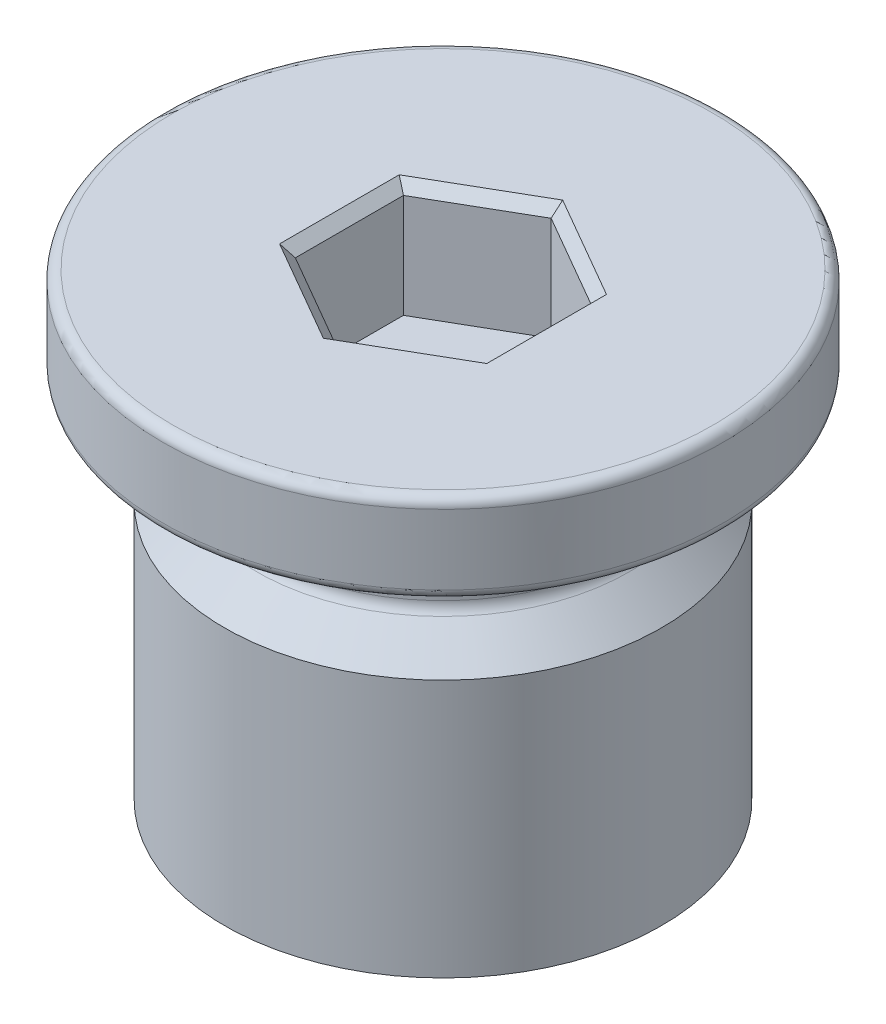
from build123d import *

# Parameters (mm, degrees)
CUT_EXTRUDE1_DEPTH = 2.8956
FILLET1_R          = 0.381
FILLET2_R          = 0.4064
FILLET3_R          = 0.254
CHAMFER7_SIZE      = 0.254


with BuildPart() as part:
    # Sketch1 → Base-Revolve (revolve)
    with BuildSketch(Plane.XY, mode=Mode.PRIVATE) as base_revolve_sk:
        Polygon((5.55625, 0), (5.55625, 6.55955), (4.6228, 7.493), (4.6228, 9.398), (7.1247, 9.398), (7.1247, 11.684), (0, 11.684), (0, 0), align=None)
    revolve(base_revolve_sk.sketch.rotate(Axis((0, 0, 0), (0, 1, 0)), 90), axis=Axis((0, 0, 0), (0, 1, 0)))

    # Sketch2 → Cut-Extrude1 (cut)
    with BuildSketch(Plane(origin=(0, 11.684, 0), x_dir=(-1, 0, 0), z_dir=(0, 1, 0))):
        Polygon((0, 2.749630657), (-2.38125, 1.374815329), (-2.38125, -1.374815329), (0, -2.749630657), (2.38125, -1.374815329), (2.38125, 1.374815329), align=None)
    extrude(amount=-CUT_EXTRUDE1_DEPTH, mode=Mode.SUBTRACT)

    # Fillet1
    fillet1_edges = [part.edges().sort_by_distance(p)[0] for p in [
        (0, 7.493, 4.6228),
    ]]
    fillet(fillet1_edges, radius=FILLET1_R)

    # Fillet2
    fillet2_edges = [part.edges().sort_by_distance(p)[0] for p in [
        (0, 9.398, 4.6228),
    ]]
    fillet(fillet2_edges, radius=FILLET2_R)

    # Fillet3
    fillet3_edges = [part.edges().sort_by_distance(p)[0] for p in [
        (0, 11.684, 7.1247),
        (0, 9.398, 7.1247),
    ]]
    fillet(fillet3_edges, radius=FILLET3_R)

    # Chamfer7
    chamfer7_edges = [part.edges().sort_by_distance(p)[0] for p in [
        (-1.190625, 11.684, 2.062222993),
        (1.190625, 11.684, 2.062222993),
        (2.38125, 11.684, 0),
        (1.190625, 11.684, -2.062222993),
        (-1.190625, 11.684, -2.062222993),
        (-2.38125, 11.684, 0),
    ]]
    chamfer(chamfer7_edges, length=CHAMFER7_SIZE)


solid = part.part
